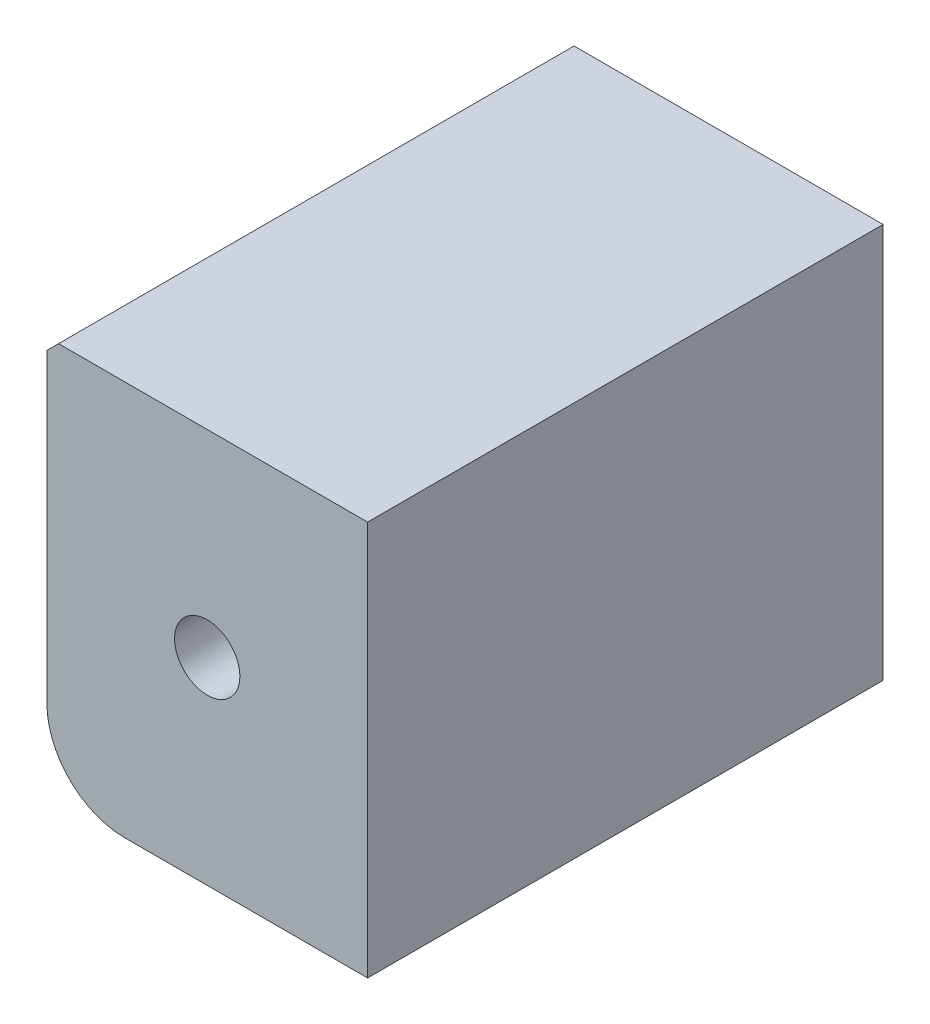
ISO-10303-21;
HEADER;
FILE_DESCRIPTION(('STEP AP214'),'2;1');
FILE_NAME('part.step','',(''),(''),'','','');
FILE_SCHEMA(('AUTOMOTIVE_DESIGN { 1 0 10303 214 1 1 1 1 }'));
ENDSEC;
DATA;
#1=APPLICATION_CONTEXT('core data for automotive mechanical design processes');
#2=APPLICATION_PROTOCOL_DEFINITION('international standard','automotive_design',2000,#1);
#3=PRODUCT_CONTEXT('',#1,'mechanical');
#4=PRODUCT('Part','Part','',(#3));
#5=PRODUCT_RELATED_PRODUCT_CATEGORY('part','',(#4));
#6=PRODUCT_DEFINITION_FORMATION('','',#4);
#7=PRODUCT_DEFINITION_CONTEXT('part definition',#1,'design');
#8=PRODUCT_DEFINITION('design','',#6,#7);
#9=PRODUCT_DEFINITION_SHAPE('','',#8);
#10=(LENGTH_UNIT() NAMED_UNIT(*) SI_UNIT(.MILLI.,.METRE.));
#11=(NAMED_UNIT(*) PLANE_ANGLE_UNIT() SI_UNIT($,.RADIAN.));
#12=(NAMED_UNIT(*) SI_UNIT($,.STERADIAN.) SOLID_ANGLE_UNIT());
#13=UNCERTAINTY_MEASURE_WITH_UNIT(LENGTH_MEASURE(1.E-05),#10,'distance_accuracy_value','');
#14=(GEOMETRIC_REPRESENTATION_CONTEXT(3) GLOBAL_UNCERTAINTY_ASSIGNED_CONTEXT((#13)) GLOBAL_UNIT_ASSIGNED_CONTEXT((#10,
#11,#12)) REPRESENTATION_CONTEXT('',''));
#15=CARTESIAN_POINT('',(0.,0.,0.));
#16=DIRECTION('',(0.,0.,1.));
#17=DIRECTION('',(1.,0.,0.));
#18=AXIS2_PLACEMENT_3D('',#15,#16,#17);
#19=CARTESIAN_POINT('',(-31.27,-40.8,66.33));
#20=DIRECTION('',(0.,0.,-1.));
#21=DIRECTION('',(-1.,0.,0.));
#22=AXIS2_PLACEMENT_3D('',#19,#20,#21);
#23=CYLINDRICAL_SURFACE('',#22,10.);
#24=CARTESIAN_POINT('',(-31.27,-40.8,0.));
#25=DIRECTION('',(0.,0.,1.));
#26=DIRECTION('',(1.,0.,0.));
#27=AXIS2_PLACEMENT_3D('',#24,#25,#26);
#28=CIRCLE('',#27,10.);
#29=CARTESIAN_POINT('',(-41.27,-40.8,0.));
#30=VERTEX_POINT('',#29);
#31=CARTESIAN_POINT('',(-31.27,-50.8,0.));
#32=VERTEX_POINT('',#31);
#33=EDGE_CURVE('E110',#30,#32,#28,.T.);
#34=ORIENTED_EDGE('',*,*,#33,.T.);
#35=DIRECTION('',(0.,0.,-1.));
#36=VECTOR('',#35,1.);
#37=CARTESIAN_POINT('',(-31.27,-50.8,66.33));
#38=LINE('',#37,#36);
#39=CARTESIAN_POINT('',(-31.27,-50.8,66.33));
#40=VERTEX_POINT('',#39);
#41=EDGE_CURVE('E142',#40,#32,#38,.T.);
#42=ORIENTED_EDGE('',*,*,#41,.F.);
#43=CARTESIAN_POINT('',(-31.27,-40.8,66.33));
#44=DIRECTION('',(0.,0.,1.));
#45=DIRECTION('',(1.,0.,0.));
#46=AXIS2_PLACEMENT_3D('',#43,#44,#45);
#47=CIRCLE('',#46,10.);
#48=CARTESIAN_POINT('',(-41.27,-40.8,66.33));
#49=VERTEX_POINT('',#48);
#50=EDGE_CURVE('E112',#49,#40,#47,.T.);
#51=ORIENTED_EDGE('',*,*,#50,.F.);
#52=DIRECTION('',(0.,0.,-1.));
#53=VECTOR('',#52,1.);
#54=CARTESIAN_POINT('',(-41.27,-40.8,66.33));
#55=LINE('',#54,#53);
#56=EDGE_CURVE('E124',#49,#30,#55,.T.);
#57=ORIENTED_EDGE('',*,*,#56,.T.);
#58=EDGE_LOOP('',(#34,#42,#51,#57));
#59=FACE_BOUND('',#58,.T.);
#60=ADVANCED_FACE('F32',(#59),#23,.T.);
#61=CARTESIAN_POINT('',(-31.27,-50.8,66.33));
#62=DIRECTION('',(0.,1.,0.));
#63=DIRECTION('',(-1.,0.,0.));
#64=AXIS2_PLACEMENT_3D('',#61,#62,#63);
#65=PLANE('',#64);
#66=DIRECTION('',(1.,0.,0.));
#67=VECTOR('',#66,1.);
#68=CARTESIAN_POINT('',(-31.27,-50.8,0.));
#69=LINE('',#68,#67);
#70=CARTESIAN_POINT('',(0.,-50.8,0.));
#71=VERTEX_POINT('',#70);
#72=EDGE_CURVE('E127',#32,#71,#69,.T.);
#73=ORIENTED_EDGE('',*,*,#72,.T.);
#74=DIRECTION('',(0.,0.,-1.));
#75=VECTOR('',#74,1.);
#76=CARTESIAN_POINT('',(0.,-50.8,66.33));
#77=LINE('',#76,#75);
#78=CARTESIAN_POINT('',(0.,-50.8,66.33));
#79=VERTEX_POINT('',#78);
#80=EDGE_CURVE('E139',#79,#71,#77,.T.);
#81=ORIENTED_EDGE('',*,*,#80,.F.);
#82=DIRECTION('',(1.,0.,0.));
#83=VECTOR('',#82,1.);
#84=CARTESIAN_POINT('',(-31.27,-50.8,66.33));
#85=LINE('',#84,#83);
#86=EDGE_CURVE('E115',#40,#79,#85,.T.);
#87=ORIENTED_EDGE('',*,*,#86,.F.);
#88=ORIENTED_EDGE('',*,*,#41,.T.);
#89=EDGE_LOOP('',(#73,#81,#87,#88));
#90=FACE_BOUND('',#89,.T.);
#91=ADVANCED_FACE('F173',(#90),#65,.F.);
#92=CARTESIAN_POINT('',(0.,-50.8,66.33));
#93=DIRECTION('',(-1.,0.,0.));
#94=DIRECTION('',(0.,-1.,0.));
#95=AXIS2_PLACEMENT_3D('',#92,#93,#94);
#96=PLANE('',#95);
#97=DIRECTION('',(0.,1.,0.));
#98=VECTOR('',#97,1.);
#99=CARTESIAN_POINT('',(0.,-50.8,0.));
#100=LINE('',#99,#98);
#101=CARTESIAN_POINT('',(0.,0.,0.));
#102=VERTEX_POINT('',#101);
#103=EDGE_CURVE('E129',#71,#102,#100,.T.);
#104=ORIENTED_EDGE('',*,*,#103,.T.);
#105=DIRECTION('',(0.,0.,-1.));
#106=VECTOR('',#105,1.);
#107=CARTESIAN_POINT('',(0.,0.,66.33));
#108=LINE('',#107,#106);
#109=CARTESIAN_POINT('',(0.,0.,66.33));
#110=VERTEX_POINT('',#109);
#111=EDGE_CURVE('E136',#110,#102,#108,.T.);
#112=ORIENTED_EDGE('',*,*,#111,.F.);
#113=DIRECTION('',(0.,1.,0.));
#114=VECTOR('',#113,1.);
#115=CARTESIAN_POINT('',(0.,-50.8,66.33));
#116=LINE('',#115,#114);
#117=EDGE_CURVE('E118',#79,#110,#116,.T.);
#118=ORIENTED_EDGE('',*,*,#117,.F.);
#119=ORIENTED_EDGE('',*,*,#80,.T.);
#120=EDGE_LOOP('',(#104,#112,#118,#119));
#121=FACE_BOUND('',#120,.T.);
#122=ADVANCED_FACE('F177',(#121),#96,.F.);
#123=CARTESIAN_POINT('',(-41.27,0.,66.33));
#124=DIRECTION('',(0.,-1.,0.));
#125=DIRECTION('',(1.,0.,0.));
#126=AXIS2_PLACEMENT_3D('',#123,#124,#125);
#127=PLANE('',#126);
#128=DIRECTION('',(-1.,0.,0.));
#129=VECTOR('',#128,1.);
#130=CARTESIAN_POINT('',(-41.27,0.,0.));
#131=LINE('',#130,#129);
#132=CARTESIAN_POINT('',(-39.77,0.,0.));
#133=VERTEX_POINT('',#132);
#134=EDGE_CURVE('E131',#102,#133,#131,.T.);
#135=ORIENTED_EDGE('',*,*,#134,.T.);
#136=DIRECTION('',(0.,0.,1.));
#137=VECTOR('',#136,1.);
#138=CARTESIAN_POINT('',(-39.77,0.,66.33));
#139=LINE('',#138,#137);
#140=CARTESIAN_POINT('',(-39.77,0.,66.33));
#141=VERTEX_POINT('',#140);
#142=EDGE_CURVE('E40',#133,#141,#139,.T.);
#143=ORIENTED_EDGE('',*,*,#142,.T.);
#144=DIRECTION('',(-1.,0.,0.));
#145=VECTOR('',#144,1.);
#146=CARTESIAN_POINT('',(-41.27,0.,66.33));
#147=LINE('',#146,#145);
#148=EDGE_CURVE('E120',#110,#141,#147,.T.);
#149=ORIENTED_EDGE('',*,*,#148,.F.);
#150=ORIENTED_EDGE('',*,*,#111,.T.);
#151=EDGE_LOOP('',(#135,#143,#149,#150));
#152=FACE_BOUND('',#151,.T.);
#153=ADVANCED_FACE('F183',(#152),#127,.F.);
#154=CARTESIAN_POINT('',(-41.27,-40.8,66.33));
#155=DIRECTION('',(1.,0.,0.));
#156=DIRECTION('',(0.,1.,0.));
#157=AXIS2_PLACEMENT_3D('',#154,#155,#156);
#158=PLANE('',#157);
#159=DIRECTION('',(0.,-1.,0.));
#160=VECTOR('',#159,1.);
#161=CARTESIAN_POINT('',(-41.27,-40.8,66.33));
#162=LINE('',#161,#160);
#163=CARTESIAN_POINT('',(-41.27,-1.49999999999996,66.33));
#164=VERTEX_POINT('',#163);
#165=EDGE_CURVE('E122',#164,#49,#162,.T.);
#166=ORIENTED_EDGE('',*,*,#165,.F.);
#167=DIRECTION('',(0.,0.,-1.));
#168=VECTOR('',#167,1.);
#169=CARTESIAN_POINT('',(-41.27,-1.49999999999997,66.33));
#170=LINE('',#169,#168);
#171=CARTESIAN_POINT('',(-41.27,-1.49999999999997,0.));
#172=VERTEX_POINT('',#171);
#173=EDGE_CURVE('E144',#164,#172,#170,.T.);
#174=ORIENTED_EDGE('',*,*,#173,.T.);
#175=DIRECTION('',(0.,-1.,0.));
#176=VECTOR('',#175,1.);
#177=CARTESIAN_POINT('',(-41.27,-40.8,0.));
#178=LINE('',#177,#176);
#179=EDGE_CURVE('E116',#172,#30,#178,.T.);
#180=ORIENTED_EDGE('',*,*,#179,.T.);
#181=ORIENTED_EDGE('',*,*,#56,.F.);
#182=EDGE_LOOP('',(#166,#174,#180,#181));
#183=FACE_BOUND('',#182,.T.);
#184=ADVANCED_FACE('F151',(#183),#158,.F.);
#185=CARTESIAN_POINT('',(-31.27,-40.8,66.33));
#186=DIRECTION('',(0.,0.,1.));
#187=DIRECTION('',(1.,0.,0.));
#188=AXIS2_PLACEMENT_3D('',#185,#186,#187);
#189=PLANE('',#188);
#190=CARTESIAN_POINT('',(-20.635,-25.4,66.33));
#191=DIRECTION('',(0.,0.,1.));
#192=DIRECTION('',(1.,0.,0.));
#193=AXIS2_PLACEMENT_3D('',#190,#191,#192);
#194=CIRCLE('',#193,4.2);
#195=CARTESIAN_POINT('',(-16.435,-25.4,66.33));
#196=VERTEX_POINT('',#195);
#197=EDGE_CURVE('E96',#196,#196,#194,.T.);
#198=ORIENTED_EDGE('',*,*,#197,.F.);
#199=EDGE_LOOP('',(#198));
#200=FACE_BOUND('',#199,.T.);
#201=ORIENTED_EDGE('',*,*,#148,.T.);
#202=DIRECTION('',(0.707106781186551,0.707106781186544,0.));
#203=VECTOR('',#202,1.);
#204=CARTESIAN_POINT('',(-55.92,-16.1499999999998,66.33));
#205=LINE('',#204,#203);
#206=EDGE_CURVE('E11',#141,#164,#205,.F.);
#207=ORIENTED_EDGE('',*,*,#206,.T.);
#208=ORIENTED_EDGE('',*,*,#165,.T.);
#209=ORIENTED_EDGE('',*,*,#50,.T.);
#210=ORIENTED_EDGE('',*,*,#86,.T.);
#211=ORIENTED_EDGE('',*,*,#117,.T.);
#212=EDGE_LOOP('',(#201,#207,#208,#209,#210,#211));
#213=FACE_BOUND('',#212,.T.);
#214=ADVANCED_FACE('F162',(#200,#213),#189,.T.);
#215=CARTESIAN_POINT('',(-31.27,-40.8,0.));
#216=DIRECTION('',(0.,0.,1.));
#217=DIRECTION('',(1.,0.,0.));
#218=AXIS2_PLACEMENT_3D('',#215,#216,#217);
#219=PLANE('',#218);
#220=CARTESIAN_POINT('',(-20.635,-39.4,0.));
#221=DIRECTION('',(0.,0.,-1.));
#222=DIRECTION('',(-1.,0.,0.));
#223=AXIS2_PLACEMENT_3D('',#220,#221,#222);
#224=CIRCLE('',#223,3.);
#225=CARTESIAN_POINT('',(-23.635,-39.4,0.));
#226=VERTEX_POINT('',#225);
#227=EDGE_CURVE('E222',#226,#226,#224,.T.);
#228=ORIENTED_EDGE('',*,*,#227,.F.);
#229=EDGE_LOOP('',(#228));
#230=FACE_BOUND('',#229,.T.);
#231=CARTESIAN_POINT('',(-20.635,-25.4,0.));
#232=DIRECTION('',(0.,0.,-1.));
#233=DIRECTION('',(-1.,0.,0.));
#234=AXIS2_PLACEMENT_3D('',#231,#232,#233);
#235=CIRCLE('',#234,9.01);
#236=CARTESIAN_POINT('',(-29.645,-25.4,0.));
#237=VERTEX_POINT('',#236);
#238=EDGE_CURVE('E107',#237,#237,#235,.T.);
#239=ORIENTED_EDGE('',*,*,#238,.F.);
#240=EDGE_LOOP('',(#239));
#241=FACE_BOUND('',#240,.T.);
#242=ORIENTED_EDGE('',*,*,#179,.F.);
#243=DIRECTION('',(-0.707106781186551,-0.707106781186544,0.));
#244=VECTOR('',#243,1.);
#245=CARTESIAN_POINT('',(-41.27,-1.49999999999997,0.));
#246=LINE('',#245,#244);
#247=EDGE_CURVE('E54',#172,#133,#246,.F.);
#248=ORIENTED_EDGE('',*,*,#247,.T.);
#249=ORIENTED_EDGE('',*,*,#134,.F.);
#250=ORIENTED_EDGE('',*,*,#103,.F.);
#251=ORIENTED_EDGE('',*,*,#72,.F.);
#252=ORIENTED_EDGE('',*,*,#33,.F.);
#253=EDGE_LOOP('',(#242,#248,#249,#250,#251,#252));
#254=FACE_BOUND('',#253,.T.);
#255=ADVANCED_FACE('F156',(#230,#241,#254),#219,.F.);
#256=CARTESIAN_POINT('',(-20.635,-25.4,44.33));
#257=DIRECTION('',(0.,0.,1.));
#258=DIRECTION('',(1.,0.,0.));
#259=AXIS2_PLACEMENT_3D('',#256,#257,#258);
#260=CYLINDRICAL_SURFACE('',#259,4.2);
#261=CARTESIAN_POINT('',(-20.635,-25.4,44.33));
#262=DIRECTION('',(0.,0.,1.));
#263=DIRECTION('',(1.,0.,0.));
#264=AXIS2_PLACEMENT_3D('',#261,#262,#263);
#265=CIRCLE('',#264,4.2);
#266=CARTESIAN_POINT('',(-16.435,-25.4,44.33));
#267=VERTEX_POINT('',#266);
#268=EDGE_CURVE('E100',#267,#267,#265,.T.);
#269=ORIENTED_EDGE('',*,*,#268,.F.);
#270=EDGE_LOOP('',(#269));
#271=FACE_BOUND('',#270,.T.);
#272=ORIENTED_EDGE('',*,*,#197,.T.);
#273=EDGE_LOOP('',(#272));
#274=FACE_BOUND('',#273,.T.);
#275=ADVANCED_FACE('F191',(#271,#274),#260,.F.);
#276=CARTESIAN_POINT('',(-20.635,-25.4,44.33));
#277=DIRECTION('',(0.,0.,1.));
#278=DIRECTION('',(1.,0.,0.));
#279=AXIS2_PLACEMENT_3D('',#276,#277,#278);
#280=PLANE('',#279);
#281=ORIENTED_EDGE('',*,*,#268,.T.);
#282=EDGE_LOOP('',(#281));
#283=FACE_BOUND('',#282,.T.);
#284=ADVANCED_FACE('F198',(#283),#280,.T.);
#285=CARTESIAN_POINT('',(-20.635,-25.4,8.));
#286=DIRECTION('',(0.,0.,-1.));
#287=DIRECTION('',(-1.,0.,0.));
#288=AXIS2_PLACEMENT_3D('',#285,#286,#287);
#289=PLANE('',#288);
#290=CARTESIAN_POINT('',(-20.635,-25.4,8.));
#291=DIRECTION('',(0.,0.,-1.));
#292=DIRECTION('',(-1.,0.,0.));
#293=AXIS2_PLACEMENT_3D('',#290,#291,#292);
#294=CIRCLE('',#293,9.01);
#295=CARTESIAN_POINT('',(-29.645,-25.4,8.));
#296=VERTEX_POINT('',#295);
#297=EDGE_CURVE('E103',#296,#296,#294,.T.);
#298=ORIENTED_EDGE('',*,*,#297,.T.);
#299=EDGE_LOOP('',(#298));
#300=FACE_BOUND('',#299,.T.);
#301=CARTESIAN_POINT('',(-20.635,-25.4,8.));
#302=DIRECTION('',(0.,0.,-1.));
#303=DIRECTION('',(-1.,0.,0.));
#304=AXIS2_PLACEMENT_3D('',#301,#302,#303);
#305=CIRCLE('',#304,4.2);
#306=CARTESIAN_POINT('',(-24.835,-25.4,8.));
#307=VERTEX_POINT('',#306);
#308=EDGE_CURVE('E97',#307,#307,#305,.F.);
#309=ORIENTED_EDGE('',*,*,#308,.T.);
#310=EDGE_LOOP('',(#309));
#311=FACE_BOUND('',#310,.T.);
#312=ADVANCED_FACE('F202',(#300,#311),#289,.T.);
#313=CARTESIAN_POINT('',(-20.635,-25.4,8.));
#314=DIRECTION('',(0.,0.,-1.));
#315=DIRECTION('',(-1.,0.,0.));
#316=AXIS2_PLACEMENT_3D('',#313,#314,#315);
#317=CYLINDRICAL_SURFACE('',#316,9.01);
#318=ORIENTED_EDGE('',*,*,#297,.F.);
#319=EDGE_LOOP('',(#318));
#320=FACE_BOUND('',#319,.T.);
#321=ORIENTED_EDGE('',*,*,#238,.T.);
#322=EDGE_LOOP('',(#321));
#323=FACE_BOUND('',#322,.T.);
#324=ADVANCED_FACE('F90',(#320,#323),#317,.F.);
#325=CARTESIAN_POINT('',(-20.635,-25.4,22.));
#326=DIRECTION('',(0.,0.,-1.));
#327=DIRECTION('',(-1.,0.,0.));
#328=AXIS2_PLACEMENT_3D('',#325,#326,#327);
#329=CONICAL_SURFACE('',#328,4.2,1.0471975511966);
#330=CARTESIAN_POINT('',(-20.635,-25.4,24.4248711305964));
#331=VERTEX_POINT('',#330);
#332=VERTEX_LOOP('',#331);
#333=FACE_BOUND('',#332,.T.);
#334=CARTESIAN_POINT('',(-20.635,-25.4,22.));
#335=DIRECTION('',(0.,0.,-1.));
#336=DIRECTION('',(-1.,0.,0.));
#337=AXIS2_PLACEMENT_3D('',#334,#335,#336);
#338=CIRCLE('',#337,4.2);
#339=CARTESIAN_POINT('',(-24.835,-25.4,22.));
#340=VERTEX_POINT('',#339);
#341=EDGE_CURVE('E94',#340,#340,#338,.T.);
#342=ORIENTED_EDGE('',*,*,#341,.T.);
#343=EDGE_LOOP('',(#342));
#344=FACE_BOUND('',#343,.T.);
#345=ADVANCED_FACE('F86',(#333,#344),#329,.F.);
#346=CARTESIAN_POINT('',(-20.635,-25.4,22.));
#347=DIRECTION('',(0.,0.,-1.));
#348=DIRECTION('',(-1.,0.,0.));
#349=AXIS2_PLACEMENT_3D('',#346,#347,#348);
#350=CYLINDRICAL_SURFACE('',#349,4.2);
#351=ORIENTED_EDGE('',*,*,#341,.F.);
#352=EDGE_LOOP('',(#351));
#353=FACE_BOUND('',#352,.T.);
#354=ORIENTED_EDGE('',*,*,#308,.F.);
#355=EDGE_LOOP('',(#354));
#356=FACE_BOUND('',#355,.T.);
#357=ADVANCED_FACE('F89',(#353,#356),#350,.F.);
#358=CARTESIAN_POINT('',(-20.635,-39.4,8.));
#359=DIRECTION('',(0.,0.,-1.));
#360=DIRECTION('',(-1.,0.,0.));
#361=AXIS2_PLACEMENT_3D('',#358,#359,#360);
#362=CYLINDRICAL_SURFACE('',#361,3.);
#363=CARTESIAN_POINT('',(-20.635,-39.4,8.));
#364=DIRECTION('',(0.,0.,-1.));
#365=DIRECTION('',(-1.,0.,0.));
#366=AXIS2_PLACEMENT_3D('',#363,#364,#365);
#367=CIRCLE('',#366,3.);
#368=CARTESIAN_POINT('',(-23.635,-39.4,8.));
#369=VERTEX_POINT('',#368);
#370=EDGE_CURVE('E219',#369,#369,#367,.T.);
#371=ORIENTED_EDGE('',*,*,#370,.F.);
#372=EDGE_LOOP('',(#371));
#373=FACE_BOUND('',#372,.T.);
#374=ORIENTED_EDGE('',*,*,#227,.T.);
#375=EDGE_LOOP('',(#374));
#376=FACE_BOUND('',#375,.T.);
#377=ADVANCED_FACE('F169',(#373,#376),#362,.F.);
#378=CARTESIAN_POINT('',(-20.635,-39.4,8.));
#379=DIRECTION('',(0.,0.,-1.));
#380=DIRECTION('',(-1.,0.,0.));
#381=AXIS2_PLACEMENT_3D('',#378,#379,#380);
#382=PLANE('',#381);
#383=ORIENTED_EDGE('',*,*,#370,.T.);
#384=EDGE_LOOP('',(#383));
#385=FACE_BOUND('',#384,.T.);
#386=ADVANCED_FACE('F165',(#385),#382,.T.);
#387=CARTESIAN_POINT('',(-41.27,-1.49999999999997,66.33));
#388=DIRECTION('',(0.707106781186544,-0.707106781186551,0.));
#389=DIRECTION('',(0.707106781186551,0.707106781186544,0.));
#390=AXIS2_PLACEMENT_3D('',#387,#388,#389);
#391=PLANE('',#390);
#392=ORIENTED_EDGE('',*,*,#206,.F.);
#393=ORIENTED_EDGE('',*,*,#142,.F.);
#394=ORIENTED_EDGE('',*,*,#247,.F.);
#395=ORIENTED_EDGE('',*,*,#173,.F.);
#396=EDGE_LOOP('',(#392,#393,#394,#395));
#397=FACE_BOUND('',#396,.T.);
#398=ADVANCED_FACE('F34',(#397),#391,.F.);
#399=CLOSED_SHELL('',(#60,#91,#122,#153,#184,#214,#255,#275,#284,#312,#324,#345,#357,#377,#386,#398));
#400=MANIFOLD_SOLID_BREP('B2',#399);
#401=ADVANCED_BREP_SHAPE_REPRESENTATION('',(#18,#400),#14);
#402=SHAPE_DEFINITION_REPRESENTATION(#9,#401);
ENDSEC;
END-ISO-10303-21;
